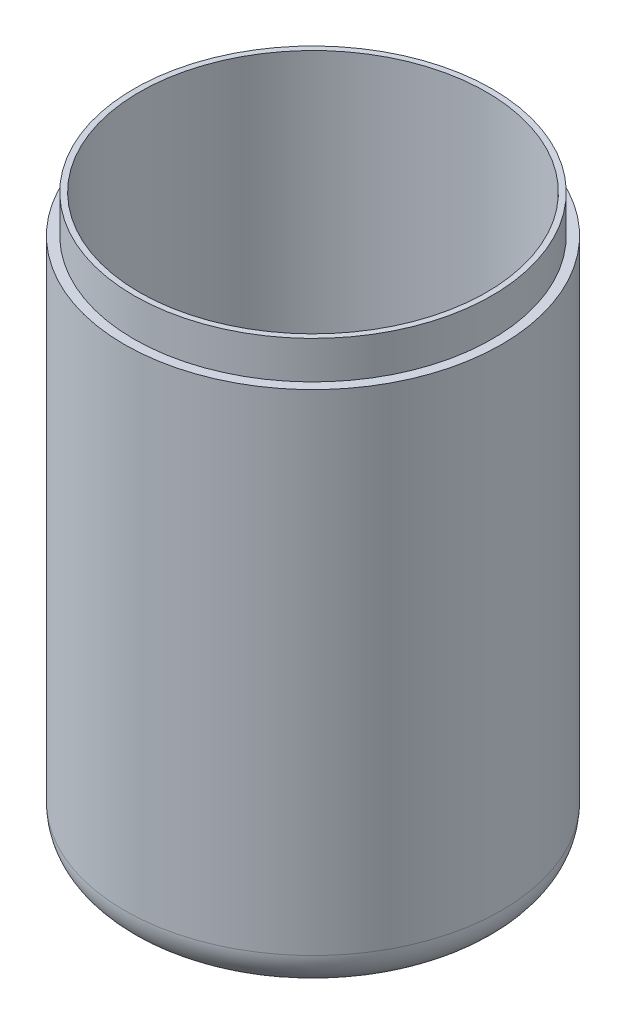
ISO-10303-21;
HEADER;
FILE_DESCRIPTION(('STEP AP214'),'2;1');
FILE_NAME('part.step','',(''),(''),'','','');
FILE_SCHEMA(('AUTOMOTIVE_DESIGN { 1 0 10303 214 1 1 1 1 }'));
ENDSEC;
DATA;
#1=APPLICATION_CONTEXT('core data for automotive mechanical design processes');
#2=APPLICATION_PROTOCOL_DEFINITION('international standard','automotive_design',2000,#1);
#3=PRODUCT_CONTEXT('',#1,'mechanical');
#4=PRODUCT('Part','Part','',(#3));
#5=PRODUCT_RELATED_PRODUCT_CATEGORY('part','',(#4));
#6=PRODUCT_DEFINITION_FORMATION('','',#4);
#7=PRODUCT_DEFINITION_CONTEXT('part definition',#1,'design');
#8=PRODUCT_DEFINITION('design','',#6,#7);
#9=PRODUCT_DEFINITION_SHAPE('','',#8);
#10=(LENGTH_UNIT() NAMED_UNIT(*) SI_UNIT(.MILLI.,.METRE.));
#11=(NAMED_UNIT(*) PLANE_ANGLE_UNIT() SI_UNIT($,.RADIAN.));
#12=(NAMED_UNIT(*) SI_UNIT($,.STERADIAN.) SOLID_ANGLE_UNIT());
#13=UNCERTAINTY_MEASURE_WITH_UNIT(LENGTH_MEASURE(1.E-05),#10,'distance_accuracy_value','');
#14=(GEOMETRIC_REPRESENTATION_CONTEXT(3) GLOBAL_UNCERTAINTY_ASSIGNED_CONTEXT((#13)) GLOBAL_UNIT_ASSIGNED_CONTEXT((#10,
#11,#12)) REPRESENTATION_CONTEXT('',''));
#15=CARTESIAN_POINT('',(0.,0.,0.));
#16=DIRECTION('',(0.,0.,1.));
#17=DIRECTION('',(1.,0.,0.));
#18=AXIS2_PLACEMENT_3D('',#15,#16,#17);
#19=CARTESIAN_POINT('',(5.89316280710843,150.,2.08391867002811));
#20=DIRECTION('',(0.,-1.,0.));
#21=DIRECTION('',(0.,0.,-1.));
#22=AXIS2_PLACEMENT_3D('',#19,#20,#21);
#23=CYLINDRICAL_SURFACE('',#22,50.);
#24=CARTESIAN_POINT('',(5.89316280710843,10.,2.08391867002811));
#25=DIRECTION('',(0.,1.,0.));
#26=DIRECTION('',(0.,0.,1.));
#27=AXIS2_PLACEMENT_3D('',#24,#25,#26);
#28=CIRCLE('',#27,50.);
#29=CARTESIAN_POINT('',(5.89316280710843,10.,52.0839186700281));
#30=VERTEX_POINT('',#29);
#31=EDGE_CURVE('E44',#30,#30,#28,.T.);
#32=ORIENTED_EDGE('',*,*,#31,.T.);
#33=EDGE_LOOP('',(#32));
#34=FACE_BOUND('',#33,.T.);
#35=CARTESIAN_POINT('',(5.89316280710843,140.,2.08391867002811));
#36=DIRECTION('',(0.,1.,0.));
#37=DIRECTION('',(0.,0.,1.));
#38=AXIS2_PLACEMENT_3D('',#35,#36,#37);
#39=CIRCLE('',#38,50.);
#40=CARTESIAN_POINT('',(5.89316280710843,140.,52.0839186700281));
#41=VERTEX_POINT('',#40);
#42=EDGE_CURVE('E48',#41,#41,#39,.T.);
#43=ORIENTED_EDGE('',*,*,#42,.F.);
#44=EDGE_LOOP('',(#43));
#45=FACE_BOUND('',#44,.T.);
#46=ADVANCED_FACE('F37',(#34,#45),#23,.T.);
#47=CARTESIAN_POINT('',(5.89316280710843,0.,2.08391867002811));
#48=DIRECTION('',(0.,1.,0.));
#49=DIRECTION('',(0.,0.,1.));
#50=AXIS2_PLACEMENT_3D('',#47,#48,#49);
#51=PLANE('',#50);
#52=CARTESIAN_POINT('',(5.89316280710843,0.,2.08391867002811));
#53=DIRECTION('',(0.,1.,0.));
#54=DIRECTION('',(0.,0.,1.));
#55=AXIS2_PLACEMENT_3D('',#52,#53,#54);
#56=CIRCLE('',#55,40.);
#57=CARTESIAN_POINT('',(5.89316280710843,0.,42.0839186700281));
#58=VERTEX_POINT('',#57);
#59=EDGE_CURVE('E10',#58,#58,#56,.F.);
#60=ORIENTED_EDGE('',*,*,#59,.T.);
#61=EDGE_LOOP('',(#60));
#62=FACE_BOUND('',#61,.T.);
#63=ADVANCED_FACE('F84',(#62),#51,.F.);
#64=CARTESIAN_POINT('',(5.89316280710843,140.,2.08391867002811));
#65=DIRECTION('',(0.,1.,0.));
#66=DIRECTION('',(0.,0.,1.));
#67=AXIS2_PLACEMENT_3D('',#64,#65,#66);
#68=CYLINDRICAL_SURFACE('',#67,47.5);
#69=CARTESIAN_POINT('',(5.89316280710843,140.,2.08391867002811));
#70=DIRECTION('',(0.,1.,0.));
#71=DIRECTION('',(0.,0.,1.));
#72=AXIS2_PLACEMENT_3D('',#69,#70,#71);
#73=CIRCLE('',#72,47.5);
#74=CARTESIAN_POINT('',(5.89316280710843,140.,49.5839186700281));
#75=VERTEX_POINT('',#74);
#76=EDGE_CURVE('E52',#75,#75,#73,.T.);
#77=ORIENTED_EDGE('',*,*,#76,.T.);
#78=EDGE_LOOP('',(#77));
#79=FACE_BOUND('',#78,.T.);
#80=CARTESIAN_POINT('',(5.89316280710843,150.,2.08391867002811));
#81=DIRECTION('',(0.,1.,0.));
#82=DIRECTION('',(0.,0.,1.));
#83=AXIS2_PLACEMENT_3D('',#80,#81,#82);
#84=CIRCLE('',#83,47.5);
#85=CARTESIAN_POINT('',(5.89316280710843,150.,49.5839186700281));
#86=VERTEX_POINT('',#85);
#87=EDGE_CURVE('E55',#86,#86,#84,.T.);
#88=ORIENTED_EDGE('',*,*,#87,.F.);
#89=EDGE_LOOP('',(#88));
#90=FACE_BOUND('',#89,.T.);
#91=ADVANCED_FACE('F82',(#79,#90),#68,.T.);
#92=CARTESIAN_POINT('',(0.,140.,0.));
#93=DIRECTION('',(0.,1.,0.));
#94=DIRECTION('',(0.,0.,1.));
#95=AXIS2_PLACEMENT_3D('',#92,#93,#94);
#96=PLANE('',#95);
#97=ORIENTED_EDGE('',*,*,#76,.F.);
#98=EDGE_LOOP('',(#97));
#99=FACE_BOUND('',#98,.T.);
#100=ORIENTED_EDGE('',*,*,#42,.T.);
#101=EDGE_LOOP('',(#100));
#102=FACE_BOUND('',#101,.T.);
#103=ADVANCED_FACE('F78',(#99,#102),#96,.T.);
#104=CARTESIAN_POINT('',(5.89316280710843,150.,2.08391867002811));
#105=DIRECTION('',(0.,1.,0.));
#106=DIRECTION('',(0.,0.,1.));
#107=AXIS2_PLACEMENT_3D('',#104,#105,#106);
#108=PLANE('',#107);
#109=CARTESIAN_POINT('',(5.89316280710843,150.,2.08391867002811));
#110=DIRECTION('',(0.,1.,0.));
#111=DIRECTION('',(0.,0.,1.));
#112=AXIS2_PLACEMENT_3D('',#109,#110,#111);
#113=CIRCLE('',#112,46.0287761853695);
#114=CARTESIAN_POINT('',(5.89316280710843,150.,48.1126948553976));
#115=VERTEX_POINT('',#114);
#116=EDGE_CURVE('E61',#115,#115,#113,.T.);
#117=ORIENTED_EDGE('',*,*,#116,.F.);
#118=EDGE_LOOP('',(#117));
#119=FACE_BOUND('',#118,.T.);
#120=ORIENTED_EDGE('',*,*,#87,.T.);
#121=EDGE_LOOP('',(#120));
#122=FACE_BOUND('',#121,.T.);
#123=ADVANCED_FACE('F72',(#119,#122),#108,.T.);
#124=CARTESIAN_POINT('',(5.89316280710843,17.,2.08391867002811));
#125=DIRECTION('',(0.,1.,0.));
#126=DIRECTION('',(0.,0.,1.));
#127=AXIS2_PLACEMENT_3D('',#124,#125,#126);
#128=CYLINDRICAL_SURFACE('',#127,46.0287761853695);
#129=CARTESIAN_POINT('',(5.89316280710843,17.,2.08391867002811));
#130=DIRECTION('',(0.,1.,0.));
#131=DIRECTION('',(0.,0.,1.));
#132=AXIS2_PLACEMENT_3D('',#129,#130,#131);
#133=CIRCLE('',#132,46.0287761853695);
#134=CARTESIAN_POINT('',(5.89316280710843,17.,48.1126948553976));
#135=VERTEX_POINT('',#134);
#136=EDGE_CURVE('E57',#135,#135,#133,.T.);
#137=ORIENTED_EDGE('',*,*,#136,.F.);
#138=EDGE_LOOP('',(#137));
#139=FACE_BOUND('',#138,.T.);
#140=ORIENTED_EDGE('',*,*,#116,.T.);
#141=EDGE_LOOP('',(#140));
#142=FACE_BOUND('',#141,.T.);
#143=ADVANCED_FACE('F69',(#139,#142),#128,.F.);
#144=CARTESIAN_POINT('',(5.89316280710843,17.,2.08391867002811));
#145=DIRECTION('',(0.,1.,0.));
#146=DIRECTION('',(0.,0.,1.));
#147=AXIS2_PLACEMENT_3D('',#144,#145,#146);
#148=PLANE('',#147);
#149=ORIENTED_EDGE('',*,*,#136,.T.);
#150=EDGE_LOOP('',(#149));
#151=FACE_BOUND('',#150,.T.);
#152=ADVANCED_FACE('F67',(#151),#148,.T.);
#153=CARTESIAN_POINT('',(5.89316280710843,10.,2.08391867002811));
#154=DIRECTION('',(0.,1.,0.));
#155=DIRECTION('',(0.,0.,1.));
#156=AXIS2_PLACEMENT_3D('',#153,#154,#155);
#157=TOROIDAL_SURFACE('',#156,40.,10.);
#158=ORIENTED_EDGE('',*,*,#59,.F.);
#159=EDGE_LOOP('',(#158));
#160=FACE_BOUND('',#159,.T.);
#161=ORIENTED_EDGE('',*,*,#31,.F.);
#162=EDGE_LOOP('',(#161));
#163=FACE_BOUND('',#162,.T.);
#164=ADVANCED_FACE('F39',(#160,#163),#157,.T.);
#165=CLOSED_SHELL('',(#46,#63,#91,#103,#123,#143,#152,#164));
#166=MANIFOLD_SOLID_BREP('B2',#165);
#167=ADVANCED_BREP_SHAPE_REPRESENTATION('',(#18,#166),#14);
#168=SHAPE_DEFINITION_REPRESENTATION(#9,#167);
ENDSEC;
END-ISO-10303-21;
